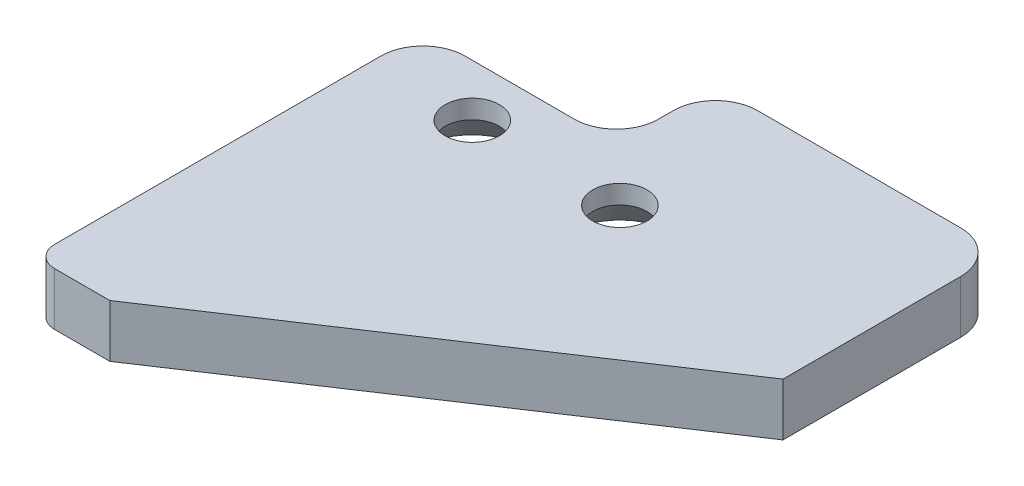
ISO-10303-21;
HEADER;
FILE_DESCRIPTION(('STEP AP214'),'2;1');
FILE_NAME('part.step','',(''),(''),'','','');
FILE_SCHEMA(('AUTOMOTIVE_DESIGN { 1 0 10303 214 1 1 1 1 }'));
ENDSEC;
DATA;
#1=APPLICATION_CONTEXT('core data for automotive mechanical design processes');
#2=APPLICATION_PROTOCOL_DEFINITION('international standard','automotive_design',2000,#1);
#3=PRODUCT_CONTEXT('',#1,'mechanical');
#4=PRODUCT('Part','Part','',(#3));
#5=PRODUCT_RELATED_PRODUCT_CATEGORY('part','',(#4));
#6=PRODUCT_DEFINITION_FORMATION('','',#4);
#7=PRODUCT_DEFINITION_CONTEXT('part definition',#1,'design');
#8=PRODUCT_DEFINITION('design','',#6,#7);
#9=PRODUCT_DEFINITION_SHAPE('','',#8);
#10=(LENGTH_UNIT() NAMED_UNIT(*) SI_UNIT(.MILLI.,.METRE.));
#11=(NAMED_UNIT(*) PLANE_ANGLE_UNIT() SI_UNIT($,.RADIAN.));
#12=(NAMED_UNIT(*) SI_UNIT($,.STERADIAN.) SOLID_ANGLE_UNIT());
#13=UNCERTAINTY_MEASURE_WITH_UNIT(LENGTH_MEASURE(1.E-05),#10,'distance_accuracy_value','');
#14=(GEOMETRIC_REPRESENTATION_CONTEXT(3) GLOBAL_UNCERTAINTY_ASSIGNED_CONTEXT((#13)) GLOBAL_UNIT_ASSIGNED_CONTEXT((#10,
#11,#12)) REPRESENTATION_CONTEXT('',''));
#15=CARTESIAN_POINT('',(0.,0.,0.));
#16=DIRECTION('',(0.,0.,1.));
#17=DIRECTION('',(1.,0.,0.));
#18=AXIS2_PLACEMENT_3D('',#15,#16,#17);
#19=CARTESIAN_POINT('',(-12.144081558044,3.175,15.6036883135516));
#20=DIRECTION('',(0.,1.,0.));
#21=DIRECTION('',(0.,0.,1.));
#22=AXIS2_PLACEMENT_3D('',#19,#20,#21);
#23=CYLINDRICAL_SURFACE('',#22,1.27);
#24=DIRECTION('',(0.,1.,0.));
#25=VECTOR('',#24,1.);
#26=CARTESIAN_POINT('',(-13.414081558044,3.175,15.6036883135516));
#27=LINE('',#26,#25);
#28=CARTESIAN_POINT('',(-13.414081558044,0.,15.6036883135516));
#29=VERTEX_POINT('',#28);
#30=CARTESIAN_POINT('',(-13.414081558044,3.175,15.6036883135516));
#31=VERTEX_POINT('',#30);
#32=EDGE_CURVE('E335',#29,#31,#27,.T.);
#33=ORIENTED_EDGE('',*,*,#32,.F.);
#34=CARTESIAN_POINT('',(-12.144081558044,0.,15.6036883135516));
#35=DIRECTION('',(0.,-1.,0.));
#36=DIRECTION('',(0.,0.,-1.));
#37=AXIS2_PLACEMENT_3D('',#34,#35,#36);
#38=CIRCLE('',#37,1.27);
#39=CARTESIAN_POINT('',(-12.144081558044,0.,16.8736883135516));
#40=VERTEX_POINT('',#39);
#41=EDGE_CURVE('E55',#40,#29,#38,.T.);
#42=ORIENTED_EDGE('',*,*,#41,.F.);
#43=DIRECTION('',(0.,1.,0.));
#44=VECTOR('',#43,1.);
#45=CARTESIAN_POINT('',(-12.144081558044,3.175,16.8736883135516));
#46=LINE('',#45,#44);
#47=CARTESIAN_POINT('',(-12.144081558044,3.175,16.8736883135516));
#48=VERTEX_POINT('',#47);
#49=EDGE_CURVE('E339',#48,#40,#46,.F.);
#50=ORIENTED_EDGE('',*,*,#49,.F.);
#51=CARTESIAN_POINT('',(-12.144081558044,3.175,15.6036883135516));
#52=DIRECTION('',(0.,-1.,0.));
#53=DIRECTION('',(0.,0.,-1.));
#54=AXIS2_PLACEMENT_3D('',#51,#52,#53);
#55=CIRCLE('',#54,1.27);
#56=EDGE_CURVE('E11',#31,#48,#55,.F.);
#57=ORIENTED_EDGE('',*,*,#56,.F.);
#58=EDGE_LOOP('',(#33,#42,#50,#57));
#59=FACE_BOUND('',#58,.T.);
#60=ADVANCED_FACE('F47',(#59),#23,.T.);
#61=CARTESIAN_POINT('',(-10.874081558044,3.175,-4.0364887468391));
#62=DIRECTION('',(0.,1.,0.));
#63=DIRECTION('',(0.,0.,1.));
#64=AXIS2_PLACEMENT_3D('',#61,#62,#63);
#65=CYLINDRICAL_SURFACE('',#64,2.54);
#66=DIRECTION('',(0.,1.,0.));
#67=VECTOR('',#66,1.);
#68=CARTESIAN_POINT('',(-10.874081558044,3.175,-6.5764887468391));
#69=LINE('',#68,#67);
#70=CARTESIAN_POINT('',(-10.874081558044,0.,-6.5764887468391));
#71=VERTEX_POINT('',#70);
#72=CARTESIAN_POINT('',(-10.874081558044,3.175,-6.5764887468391));
#73=VERTEX_POINT('',#72);
#74=EDGE_CURVE('E282',#71,#73,#69,.T.);
#75=ORIENTED_EDGE('',*,*,#74,.F.);
#76=CARTESIAN_POINT('',(-10.874081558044,0.,-4.0364887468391));
#77=DIRECTION('',(0.,-1.,0.));
#78=DIRECTION('',(0.,0.,-1.));
#79=AXIS2_PLACEMENT_3D('',#76,#77,#78);
#80=CIRCLE('',#79,2.54);
#81=CARTESIAN_POINT('',(-13.414081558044,0.,-4.0364887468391));
#82=VERTEX_POINT('',#81);
#83=EDGE_CURVE('E284',#82,#71,#80,.T.);
#84=ORIENTED_EDGE('',*,*,#83,.F.);
#85=DIRECTION('',(0.,1.,0.));
#86=VECTOR('',#85,1.);
#87=CARTESIAN_POINT('',(-13.414081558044,3.175,-4.0364887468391));
#88=LINE('',#87,#86);
#89=CARTESIAN_POINT('',(-13.414081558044,3.175,-4.0364887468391));
#90=VERTEX_POINT('',#89);
#91=EDGE_CURVE('E288',#90,#82,#88,.F.);
#92=ORIENTED_EDGE('',*,*,#91,.F.);
#93=CARTESIAN_POINT('',(-10.874081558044,3.175,-4.0364887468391));
#94=DIRECTION('',(0.,-1.,0.));
#95=DIRECTION('',(0.,0.,-1.));
#96=AXIS2_PLACEMENT_3D('',#93,#94,#95);
#97=CIRCLE('',#96,2.54);
#98=EDGE_CURVE('E286',#73,#90,#97,.F.);
#99=ORIENTED_EDGE('',*,*,#98,.F.);
#100=EDGE_LOOP('',(#75,#84,#92,#99));
#101=FACE_BOUND('',#100,.T.);
#102=ADVANCED_FACE('F272',(#101),#65,.T.);
#103=CARTESIAN_POINT('',(13.0102639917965,3.175,-10.0005375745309));
#104=DIRECTION('',(0.,-1.,0.));
#105=DIRECTION('',(0.,0.,-1.));
#106=AXIS2_PLACEMENT_3D('',#103,#104,#105);
#107=CYLINDRICAL_SURFACE('',#106,2.54);
#108=DIRECTION('',(0.,-1.,0.));
#109=VECTOR('',#108,1.);
#110=CARTESIAN_POINT('',(13.0102639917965,3.175,-12.5405375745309));
#111=LINE('',#110,#109);
#112=CARTESIAN_POINT('',(13.0102639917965,3.175,-12.5405375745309));
#113=VERTEX_POINT('',#112);
#114=CARTESIAN_POINT('',(13.0102639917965,0.,-12.5405375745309));
#115=VERTEX_POINT('',#114);
#116=EDGE_CURVE('E316',#113,#115,#111,.T.);
#117=ORIENTED_EDGE('',*,*,#116,.F.);
#118=CARTESIAN_POINT('',(13.0102639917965,3.175,-10.0005375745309));
#119=DIRECTION('',(0.,-1.,0.));
#120=DIRECTION('',(0.,0.,-1.));
#121=AXIS2_PLACEMENT_3D('',#118,#119,#120);
#122=CIRCLE('',#121,2.54);
#123=CARTESIAN_POINT('',(15.5502639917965,3.175,-10.0005375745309));
#124=VERTEX_POINT('',#123);
#125=EDGE_CURVE('E324',#124,#113,#122,.F.);
#126=ORIENTED_EDGE('',*,*,#125,.F.);
#127=DIRECTION('',(0.,-1.,0.));
#128=VECTOR('',#127,1.);
#129=CARTESIAN_POINT('',(15.5502639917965,3.175,-10.0005375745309));
#130=LINE('',#129,#128);
#131=CARTESIAN_POINT('',(15.5502639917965,0.,-10.0005375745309));
#132=VERTEX_POINT('',#131);
#133=EDGE_CURVE('E320',#132,#124,#130,.F.);
#134=ORIENTED_EDGE('',*,*,#133,.F.);
#135=CARTESIAN_POINT('',(13.0102639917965,0.,-10.0005375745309));
#136=DIRECTION('',(0.,-1.,0.));
#137=DIRECTION('',(0.,0.,-1.));
#138=AXIS2_PLACEMENT_3D('',#135,#136,#137);
#139=CIRCLE('',#138,2.54);
#140=EDGE_CURVE('E289',#115,#132,#139,.T.);
#141=ORIENTED_EDGE('',*,*,#140,.F.);
#142=EDGE_LOOP('',(#117,#126,#134,#141));
#143=FACE_BOUND('',#142,.T.);
#144=ADVANCED_FACE('F269',(#143),#107,.T.);
#145=CARTESIAN_POINT('',(-4.29986492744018,3.175,-9.1164887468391));
#146=DIRECTION('',(0.,-1.,0.));
#147=DIRECTION('',(0.,0.,-1.));
#148=AXIS2_PLACEMENT_3D('',#145,#146,#147);
#149=CYLINDRICAL_SURFACE('',#148,2.54);
#150=DIRECTION('',(0.,1.,0.));
#151=VECTOR('',#150,1.);
#152=CARTESIAN_POINT('',(-1.75986492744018,3.175,-9.1164887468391));
#153=LINE('',#152,#151);
#154=CARTESIAN_POINT('',(-1.75986492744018,0.,-9.1164887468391));
#155=VERTEX_POINT('',#154);
#156=CARTESIAN_POINT('',(-1.75986492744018,3.175,-9.1164887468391));
#157=VERTEX_POINT('',#156);
#158=EDGE_CURVE('E304',#155,#157,#153,.T.);
#159=ORIENTED_EDGE('',*,*,#158,.F.);
#160=CARTESIAN_POINT('',(-4.29986492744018,0.,-9.1164887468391));
#161=DIRECTION('',(0.,-1.,0.));
#162=DIRECTION('',(0.,0.,-1.));
#163=AXIS2_PLACEMENT_3D('',#160,#161,#162);
#164=CIRCLE('',#163,2.54);
#165=CARTESIAN_POINT('',(-4.29986492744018,0.,-6.5764887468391));
#166=VERTEX_POINT('',#165);
#167=EDGE_CURVE('E310',#155,#166,#164,.T.);
#168=ORIENTED_EDGE('',*,*,#167,.T.);
#169=DIRECTION('',(0.,1.,0.));
#170=VECTOR('',#169,1.);
#171=CARTESIAN_POINT('',(-4.29986492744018,3.175,-6.5764887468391));
#172=LINE('',#171,#170);
#173=CARTESIAN_POINT('',(-4.29986492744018,3.175,-6.5764887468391));
#174=VERTEX_POINT('',#173);
#175=EDGE_CURVE('E148',#174,#166,#172,.F.);
#176=ORIENTED_EDGE('',*,*,#175,.F.);
#177=CARTESIAN_POINT('',(-4.29986492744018,3.175,-9.1164887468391));
#178=DIRECTION('',(0.,-1.,0.));
#179=DIRECTION('',(0.,0.,-1.));
#180=AXIS2_PLACEMENT_3D('',#177,#178,#179);
#181=CIRCLE('',#180,2.54);
#182=EDGE_CURVE('E313',#174,#157,#181,.F.);
#183=ORIENTED_EDGE('',*,*,#182,.T.);
#184=EDGE_LOOP('',(#159,#168,#176,#183));
#185=FACE_BOUND('',#184,.T.);
#186=ADVANCED_FACE('F265',(#185),#149,.F.);
#187=CARTESIAN_POINT('',(0.78013507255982,3.175,-10.0005375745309));
#188=DIRECTION('',(0.,-1.,0.));
#189=DIRECTION('',(0.,0.,-1.));
#190=AXIS2_PLACEMENT_3D('',#187,#188,#189);
#191=CYLINDRICAL_SURFACE('',#190,2.54);
#192=DIRECTION('',(0.,-1.,0.));
#193=VECTOR('',#192,1.);
#194=CARTESIAN_POINT('',(-1.75986492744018,3.175,-10.0005375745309));
#195=LINE('',#194,#193);
#196=CARTESIAN_POINT('',(-1.75986492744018,3.175,-10.0005375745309));
#197=VERTEX_POINT('',#196);
#198=CARTESIAN_POINT('',(-1.75986492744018,0.,-10.0005375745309));
#199=VERTEX_POINT('',#198);
#200=EDGE_CURVE('E159',#197,#199,#195,.T.);
#201=ORIENTED_EDGE('',*,*,#200,.F.);
#202=CARTESIAN_POINT('',(0.78013507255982,3.175,-10.0005375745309));
#203=DIRECTION('',(0.,-1.,0.));
#204=DIRECTION('',(0.,0.,-1.));
#205=AXIS2_PLACEMENT_3D('',#202,#203,#204);
#206=CIRCLE('',#205,2.54);
#207=CARTESIAN_POINT('',(0.78013507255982,3.175,-12.5405375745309));
#208=VERTEX_POINT('',#207);
#209=EDGE_CURVE('E298',#208,#197,#206,.F.);
#210=ORIENTED_EDGE('',*,*,#209,.F.);
#211=DIRECTION('',(0.,-1.,0.));
#212=VECTOR('',#211,1.);
#213=CARTESIAN_POINT('',(0.78013507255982,3.175,-12.5405375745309));
#214=LINE('',#213,#212);
#215=CARTESIAN_POINT('',(0.78013507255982,0.,-12.5405375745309));
#216=VERTEX_POINT('',#215);
#217=EDGE_CURVE('E295',#216,#208,#214,.F.);
#218=ORIENTED_EDGE('',*,*,#217,.F.);
#219=CARTESIAN_POINT('',(0.78013507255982,0.,-10.0005375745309));
#220=DIRECTION('',(0.,-1.,0.));
#221=DIRECTION('',(0.,0.,-1.));
#222=AXIS2_PLACEMENT_3D('',#219,#220,#221);
#223=CIRCLE('',#222,2.54);
#224=EDGE_CURVE('E300',#199,#216,#223,.T.);
#225=ORIENTED_EDGE('',*,*,#224,.F.);
#226=EDGE_LOOP('',(#201,#210,#218,#225));
#227=FACE_BOUND('',#226,.T.);
#228=ADVANCED_FACE('F261',(#227),#191,.T.);
#229=CARTESIAN_POINT('',(-1.75986492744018,3.175,-12.5405375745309));
#230=DIRECTION('',(0.,0.,1.));
#231=DIRECTION('',(1.,0.,0.));
#232=AXIS2_PLACEMENT_3D('',#229,#230,#231);
#233=PLANE('',#232);
#234=DIRECTION('',(-1.,0.,0.));
#235=VECTOR('',#234,1.);
#236=CARTESIAN_POINT('',(-1.75986492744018,3.175,-12.5405375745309));
#237=LINE('',#236,#235);
#238=EDGE_CURVE('E189',#113,#208,#237,.T.);
#239=ORIENTED_EDGE('',*,*,#238,.F.);
#240=ORIENTED_EDGE('',*,*,#116,.T.);
#241=DIRECTION('',(-1.,0.,0.));
#242=VECTOR('',#241,1.);
#243=CARTESIAN_POINT('',(-1.75986492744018,0.,-12.5405375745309));
#244=LINE('',#243,#242);
#245=EDGE_CURVE('E188',#115,#216,#244,.T.);
#246=ORIENTED_EDGE('',*,*,#245,.T.);
#247=ORIENTED_EDGE('',*,*,#217,.T.);
#248=EDGE_LOOP('',(#239,#240,#246,#247));
#249=FACE_BOUND('',#248,.T.);
#250=ADVANCED_FACE('F257',(#249),#233,.F.);
#251=CARTESIAN_POINT('',(-1.75986492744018,3.175,-6.5764887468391));
#252=DIRECTION('',(1.,0.,0.));
#253=DIRECTION('',(0.,0.,-1.));
#254=AXIS2_PLACEMENT_3D('',#251,#252,#253);
#255=PLANE('',#254);
#256=DIRECTION('',(0.,0.,1.));
#257=VECTOR('',#256,1.);
#258=CARTESIAN_POINT('',(-1.75986492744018,0.,-6.5764887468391));
#259=LINE('',#258,#257);
#260=EDGE_CURVE('E217',#199,#155,#259,.T.);
#261=ORIENTED_EDGE('',*,*,#260,.T.);
#262=ORIENTED_EDGE('',*,*,#158,.T.);
#263=DIRECTION('',(0.,0.,1.));
#264=VECTOR('',#263,1.);
#265=CARTESIAN_POINT('',(-1.75986492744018,3.175,-6.5764887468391));
#266=LINE('',#265,#264);
#267=EDGE_CURVE('E192',#197,#157,#266,.T.);
#268=ORIENTED_EDGE('',*,*,#267,.F.);
#269=ORIENTED_EDGE('',*,*,#200,.T.);
#270=EDGE_LOOP('',(#261,#262,#268,#269));
#271=FACE_BOUND('',#270,.T.);
#272=ADVANCED_FACE('F253',(#271),#255,.F.);
#273=CARTESIAN_POINT('',(-13.414081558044,3.175,-6.5764887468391));
#274=DIRECTION('',(0.,0.,1.));
#275=DIRECTION('',(1.,0.,0.));
#276=AXIS2_PLACEMENT_3D('',#273,#274,#275);
#277=PLANE('',#276);
#278=DIRECTION('',(-1.,0.,0.));
#279=VECTOR('',#278,1.);
#280=CARTESIAN_POINT('',(-13.414081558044,0.,-6.5764887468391));
#281=LINE('',#280,#279);
#282=CARTESIAN_POINT('',(-8.66129781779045,0.,-6.5764887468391));
#283=VERTEX_POINT('',#282);
#284=EDGE_CURVE('E153',#283,#71,#281,.T.);
#285=ORIENTED_EDGE('',*,*,#284,.T.);
#286=ORIENTED_EDGE('',*,*,#74,.T.);
#287=DIRECTION('',(-1.,0.,0.));
#288=VECTOR('',#287,1.);
#289=CARTESIAN_POINT('',(-13.414081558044,3.175,-6.5764887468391));
#290=LINE('',#289,#288);
#291=EDGE_CURVE('E197',#174,#73,#290,.T.);
#292=ORIENTED_EDGE('',*,*,#291,.F.);
#293=ORIENTED_EDGE('',*,*,#175,.T.);
#294=CARTESIAN_POINT('',(-5.95817419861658,0.,-6.5764887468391));
#295=VERTEX_POINT('',#294);
#296=EDGE_CURVE('E140',#166,#295,#281,.T.);
#297=ORIENTED_EDGE('',*,*,#296,.T.);
#298=CARTESIAN_POINT('',(-17.0291242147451,-7.82422408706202,-6.5764887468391));
#299=CARTESIAN_POINT('',(-16.8010540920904,-7.57451380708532,-6.5764887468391));
#300=CARTESIAN_POINT('',(-16.572593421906,-7.32515837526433,-6.5764887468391));
#301=CARTESIAN_POINT('',(-16.1146453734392,-6.82737069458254,-6.5764887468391));
#302=CARTESIAN_POINT('',(-15.8851579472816,-6.57893848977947,-6.5764887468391));
#303=CARTESIAN_POINT('',(-15.4243137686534,-6.08256819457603,-6.5764887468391));
#304=CARTESIAN_POINT('',(-15.1929536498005,-5.83463322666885,-6.5764887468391));
#305=CARTESIAN_POINT('',(-14.728640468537,-5.34027237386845,-6.5764887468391));
#306=CARTESIAN_POINT('',(-14.4956874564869,-5.09384644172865,-6.5764887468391));
#307=CARTESIAN_POINT('',(-14.0004028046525,-4.57431715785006,-6.5764887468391));
#308=CARTESIAN_POINT('',(-13.737815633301,-4.30145708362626,-6.5764887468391));
#309=CARTESIAN_POINT('',(-13.2090855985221,-3.75913127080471,-6.5764887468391));
#310=CARTESIAN_POINT('',(-12.9429423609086,-3.48966589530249,-6.5764887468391));
#311=CARTESIAN_POINT('',(-12.5401652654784,-3.08948320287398,-6.5764887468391));
#312=CARTESIAN_POINT('',(-12.4054224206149,-2.95686334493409,-6.5764887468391));
#313=CARTESIAN_POINT('',(-12.1344046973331,-2.69320005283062,-6.5764887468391));
#314=CARTESIAN_POINT('',(-11.9981298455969,-2.56215659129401,-6.5764887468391));
#315=CARTESIAN_POINT('',(-11.723727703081,-2.30206983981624,-6.5764887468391));
#316=CARTESIAN_POINT('',(-11.5856007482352,-2.17302619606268,-6.5764887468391));
#317=CARTESIAN_POINT('',(-11.3070244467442,-1.91747562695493,-6.5764887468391));
#318=CARTESIAN_POINT('',(-11.166575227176,-1.79096856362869,-6.5764887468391));
#319=CARTESIAN_POINT('',(-10.9244081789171,-1.57793340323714,-6.5764887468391));
#320=CARTESIAN_POINT('',(-10.8234245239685,-1.49057161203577,-6.5764887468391));
#321=CARTESIAN_POINT('',(-10.6197143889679,-1.31789134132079,-6.5764887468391));
#322=CARTESIAN_POINT('',(-10.5169878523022,-1.23257292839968,-6.5764887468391));
#323=CARTESIAN_POINT('',(-10.3092370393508,-1.06430598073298,-6.5764887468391));
#324=CARTESIAN_POINT('',(-10.2042082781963,-0.981362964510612,-6.5764887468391));
#325=CARTESIAN_POINT('',(-9.99165984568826,-0.818729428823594,-6.5764887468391));
#326=CARTESIAN_POINT('',(-9.88414032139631,-0.739038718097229,-6.5764887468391));
#327=CARTESIAN_POINT('',(-9.66846355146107,-0.585522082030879,-6.5764887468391));
#328=CARTESIAN_POINT('',(-9.56037043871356,-0.511606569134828,-6.5764887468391));
#329=CARTESIAN_POINT('',(-9.34073233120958,-0.368969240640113,-6.5764887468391));
#330=CARTESIAN_POINT('',(-9.22918627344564,-0.300249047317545,-6.5764887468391));
#331=CARTESIAN_POINT('',(-9.00250433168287,-0.169934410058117,-6.5764887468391));
#332=CARTESIAN_POINT('',(-8.88738284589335,-0.108315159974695,-6.5764887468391));
#333=CARTESIAN_POINT('',(-8.65274183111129,0.00579668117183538,-6.5764887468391));
#334=CARTESIAN_POINT('',(-8.53322657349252,0.0582978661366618,-6.5764887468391));
#335=CARTESIAN_POINT('',(-8.3320119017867,0.135141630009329,-6.5764887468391));
#336=CARTESIAN_POINT('',(-8.25162862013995,0.162924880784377,-6.5764887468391));
#337=CARTESIAN_POINT('',(-8.08900554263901,0.212516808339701,-6.5764887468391));
#338=CARTESIAN_POINT('',(-8.00676554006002,0.234324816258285,-6.5764887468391));
#339=CARTESIAN_POINT('',(-7.84108625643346,0.271010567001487,-6.5764887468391));
#340=CARTESIAN_POINT('',(-7.75765321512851,0.285916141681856,-6.5764887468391));
#341=CARTESIAN_POINT('',(-7.58979275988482,0.308218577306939,-6.5764887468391));
#342=CARTESIAN_POINT('',(-7.50536554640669,0.315616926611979,-6.5764887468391));
#343=CARTESIAN_POINT('',(-7.33218731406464,0.322677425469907,-6.5764887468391));
#344=CARTESIAN_POINT('',(-7.24342025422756,0.321958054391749,-6.5764887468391));
#345=CARTESIAN_POINT('',(-7.06638236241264,0.311897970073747,-6.5764887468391));
#346=CARTESIAN_POINT('',(-6.978111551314,0.302556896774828,-6.5764887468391));
#347=CARTESIAN_POINT('',(-6.80247204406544,0.275734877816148,-6.5764887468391));
#348=CARTESIAN_POINT('',(-6.71510836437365,0.258221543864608,-6.5764887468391));
#349=CARTESIAN_POINT('',(-6.54216973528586,0.21592630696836,-6.5764887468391));
#350=CARTESIAN_POINT('',(-6.45659516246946,0.191142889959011,-6.5764887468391));
#351=CARTESIAN_POINT('',(-6.24610168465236,0.121658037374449,-6.5764887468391));
#352=CARTESIAN_POINT('',(-6.12244327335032,0.0731465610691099,-6.5764887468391));
#353=CARTESIAN_POINT('',(-5.87985345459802,-0.0344804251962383,-6.5764887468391));
#354=CARTESIAN_POINT('',(-5.7609253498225,-0.093603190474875,-6.5764887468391));
#355=CARTESIAN_POINT('',(-5.52626772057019,-0.220406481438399,-6.5764887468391));
#356=CARTESIAN_POINT('',(-5.41058062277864,-0.288164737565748,-6.5764887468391));
#357=CARTESIAN_POINT('',(-5.23994823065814,-0.394339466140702,-6.5764887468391));
#358=CARTESIAN_POINT('',(-5.18356266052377,-0.430481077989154,-6.5764887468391));
#359=CARTESIAN_POINT('',(-5.07166823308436,-0.504093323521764,-6.5764887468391));
#360=CARTESIAN_POINT('',(-5.01615933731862,-0.541563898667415,-6.5764887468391));
#361=CARTESIAN_POINT('',(-4.83070523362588,-0.669598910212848,-6.5764887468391));
#362=CARTESIAN_POINT('',(-4.70258831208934,-0.762815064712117,-6.5764887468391));
#363=CARTESIAN_POINT('',(-4.44993358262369,-0.953996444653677,-6.5764887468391));
#364=CARTESIAN_POINT('',(-4.32539674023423,-1.05196293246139,-6.5764887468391));
#365=CARTESIAN_POINT('',(-4.07912728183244,-1.25155564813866,-6.5764887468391));
#366=CARTESIAN_POINT('',(-3.95739712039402,-1.3531848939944,-6.5764887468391));
#367=CARTESIAN_POINT('',(-3.71629425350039,-1.55920933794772,-6.5764887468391));
#368=CARTESIAN_POINT('',(-3.5969217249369,-1.66360474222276,-6.5764887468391));
#369=CARTESIAN_POINT('',(-3.35962925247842,-1.87499531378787,-6.5764887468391));
#370=CARTESIAN_POINT('',(-3.24171724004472,-1.98199936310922,-6.5764887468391));
#371=CARTESIAN_POINT('',(-3.00750594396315,-2.1977604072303,-6.5764887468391));
#372=CARTESIAN_POINT('',(-2.8912067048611,-2.30651745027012,-6.5764887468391));
#373=CARTESIAN_POINT('',(-2.54443531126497,-2.63478706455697,-6.5764887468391));
#374=CARTESIAN_POINT('',(-2.31596330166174,-2.85641186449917,-6.5764887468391));
#375=CARTESIAN_POINT('',(-1.8867964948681,-3.27984622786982,-6.5764887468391));
#376=CARTESIAN_POINT('',(-1.68572019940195,-3.48127159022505,-6.5764887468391));
#377=CARTESIAN_POINT('',(-1.28586184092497,-3.88644257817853,-6.5764887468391));
#378=CARTESIAN_POINT('',(-1.08708011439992,-4.09018853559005,-6.5764887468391));
#379=CARTESIAN_POINT('',(-0.692996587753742,-4.49767947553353,-6.5764887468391));
#380=CARTESIAN_POINT('',(-0.497679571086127,-4.70140977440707,-6.5764887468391));
#381=CARTESIAN_POINT('',(-0.108506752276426,-5.11018610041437,-6.5764887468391));
#382=CARTESIAN_POINT('',(0.0853493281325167,-5.31523186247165,-6.5764887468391));
#383=CARTESIAN_POINT('',(0.278666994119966,-5.5207795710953,-6.5764887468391));
#384=B_SPLINE_CURVE_WITH_KNOTS('',3,(#298,#299,#300,#301,#302,#303,#304,#305,#306,#307,#308,
#309,#310,#311,#312,#313,#314,#315,#316,#317,#318,#319,#320,#321,#322,#323,#324,#325,#326,#327,
#328,#329,#330,#331,#332,#333,#334,#335,#336,#337,#338,#339,#340,#341,#342,#343,#344,#345,#346,
#347,#348,#349,#350,#351,#352,#353,#354,#355,#356,#357,#358,#359,#360,#361,#362,#363,#364,#365,
#366,#367,#368,#369,#370,#371,#372,#373,#374,#375,#376,#377,#378,#379,#380,#381,#382,#383),
.UNSPECIFIED.,.F.,.F.,(4,2,2,2,2,2,2,2,2,2,2,2,2,2,2,2,2,2,2,2,2,2,2,2,2,2,2,2,2,2,2,2,2,2,2,2,
2,2,2,2,2,2,4),(0.,1.01456600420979,2.02917981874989,3.04652053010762,4.06382922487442,
5.19987383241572,6.33603893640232,6.90320910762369,7.47036941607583,8.03742820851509,
8.60445607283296,9.00501943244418,9.40559582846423,9.80703769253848,10.208455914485,
10.6011887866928,10.9940437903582,11.3854819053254,11.7765490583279,12.0315052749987,
12.2864900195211,12.540437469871,12.7943345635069,13.0602122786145,13.3261010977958,
13.5930527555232,13.8600600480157,14.2578574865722,14.6559279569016,15.0578749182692,
15.2587836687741,15.4596835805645,15.9348334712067,16.4101103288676,16.88578817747,
17.3615015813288,17.8391593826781,18.3168303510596,19.271662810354,20.1254787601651,
20.9794183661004,21.8261065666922,22.672629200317),.UNSPECIFIED.);
#385=EDGE_CURVE('E144',#295,#283,#384,.F.);
#386=ORIENTED_EDGE('',*,*,#385,.T.);
#387=EDGE_LOOP('',(#285,#286,#292,#293,#297,#386));
#388=FACE_BOUND('',#387,.T.);
#389=ADVANCED_FACE('F143',(#388),#277,.F.);
#390=CARTESIAN_POINT('',(-13.414081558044,3.175,16.8736883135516));
#391=DIRECTION('',(1.,0.,0.));
#392=DIRECTION('',(0.,0.,-1.));
#393=AXIS2_PLACEMENT_3D('',#390,#391,#392);
#394=PLANE('',#393);
#395=DIRECTION('',(0.,0.,1.));
#396=VECTOR('',#395,1.);
#397=CARTESIAN_POINT('',(-13.414081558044,0.,16.8736883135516));
#398=LINE('',#397,#396);
#399=EDGE_CURVE('E152',#82,#29,#398,.T.);
#400=ORIENTED_EDGE('',*,*,#399,.T.);
#401=ORIENTED_EDGE('',*,*,#32,.T.);
#402=DIRECTION('',(0.,0.,1.));
#403=VECTOR('',#402,1.);
#404=CARTESIAN_POINT('',(-13.414081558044,3.175,16.8736883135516));
#405=LINE('',#404,#403);
#406=EDGE_CURVE('E201',#90,#31,#405,.T.);
#407=ORIENTED_EDGE('',*,*,#406,.F.);
#408=ORIENTED_EDGE('',*,*,#91,.T.);
#409=EDGE_LOOP('',(#400,#401,#407,#408));
#410=FACE_BOUND('',#409,.T.);
#411=ADVANCED_FACE('F252',(#410),#394,.F.);
#412=CARTESIAN_POINT('',(-8.82375940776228,3.175,16.8736883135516));
#413=DIRECTION('',(0.,0.,-1.));
#414=DIRECTION('',(-1.,0.,0.));
#415=AXIS2_PLACEMENT_3D('',#412,#413,#414);
#416=PLANE('',#415);
#417=DIRECTION('',(1.,0.,0.));
#418=VECTOR('',#417,1.);
#419=CARTESIAN_POINT('',(-8.82375940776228,3.175,16.8736883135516));
#420=LINE('',#419,#418);
#421=CARTESIAN_POINT('',(-8.82375940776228,3.175,16.8736883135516));
#422=VERTEX_POINT('',#421);
#423=EDGE_CURVE('E204',#48,#422,#420,.T.);
#424=ORIENTED_EDGE('',*,*,#423,.F.);
#425=ORIENTED_EDGE('',*,*,#49,.T.);
#426=DIRECTION('',(1.,0.,0.));
#427=VECTOR('',#426,1.);
#428=CARTESIAN_POINT('',(-8.82375940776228,0.,16.8736883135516));
#429=LINE('',#428,#427);
#430=CARTESIAN_POINT('',(-8.82375940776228,0.,16.8736883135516));
#431=VERTEX_POINT('',#430);
#432=EDGE_CURVE('E224',#40,#431,#429,.T.);
#433=ORIENTED_EDGE('',*,*,#432,.T.);
#434=DIRECTION('',(0.,-1.,0.));
#435=VECTOR('',#434,1.);
#436=CARTESIAN_POINT('',(-8.82375940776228,3.175,16.8736883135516));
#437=LINE('',#436,#435);
#438=EDGE_CURVE('E160',#422,#431,#437,.T.);
#439=ORIENTED_EDGE('',*,*,#438,.F.);
#440=EDGE_LOOP('',(#424,#425,#433,#439));
#441=FACE_BOUND('',#440,.T.);
#442=ADVANCED_FACE('F370',(#441),#416,.F.);
#443=CARTESIAN_POINT('',(-8.82375940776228,3.175,16.8736883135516));
#444=DIRECTION('',(-0.552919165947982,0.,-0.833234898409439));
#445=DIRECTION('',(-0.833234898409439,0.,0.552919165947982));
#446=AXIS2_PLACEMENT_3D('',#443,#444,#445);
#447=PLANE('',#446);
#448=DIRECTION('',(0.833234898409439,0.,-0.552919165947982));
#449=VECTOR('',#448,1.);
#450=CARTESIAN_POINT('',(-8.82375940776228,0.,16.8736883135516));
#451=LINE('',#450,#449);
#452=CARTESIAN_POINT('',(15.5502639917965,0.,0.699540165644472));
#453=VERTEX_POINT('',#452);
#454=EDGE_CURVE('E227',#431,#453,#451,.T.);
#455=ORIENTED_EDGE('',*,*,#454,.T.);
#456=DIRECTION('',(0.,-1.,0.));
#457=VECTOR('',#456,1.);
#458=CARTESIAN_POINT('',(15.5502639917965,3.175,0.699540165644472));
#459=LINE('',#458,#457);
#460=CARTESIAN_POINT('',(15.5502639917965,3.175,0.699540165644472));
#461=VERTEX_POINT('',#460);
#462=EDGE_CURVE('E214',#461,#453,#459,.T.);
#463=ORIENTED_EDGE('',*,*,#462,.F.);
#464=DIRECTION('',(0.833234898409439,0.,-0.552919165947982));
#465=VECTOR('',#464,1.);
#466=CARTESIAN_POINT('',(-8.82375940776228,3.175,16.8736883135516));
#467=LINE('',#466,#465);
#468=EDGE_CURVE('E207',#422,#461,#467,.T.);
#469=ORIENTED_EDGE('',*,*,#468,.F.);
#470=ORIENTED_EDGE('',*,*,#438,.T.);
#471=EDGE_LOOP('',(#455,#463,#469,#470));
#472=FACE_BOUND('',#471,.T.);
#473=ADVANCED_FACE('F366',(#472),#447,.F.);
#474=CARTESIAN_POINT('',(15.5502639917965,3.175,-12.5405375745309));
#475=DIRECTION('',(-1.,0.,0.));
#476=DIRECTION('',(0.,0.,1.));
#477=AXIS2_PLACEMENT_3D('',#474,#475,#476);
#478=PLANE('',#477);
#479=DIRECTION('',(0.,0.,-1.));
#480=VECTOR('',#479,1.);
#481=CARTESIAN_POINT('',(15.5502639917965,0.,-12.5405375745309));
#482=LINE('',#481,#480);
#483=EDGE_CURVE('E193',#453,#132,#482,.T.);
#484=ORIENTED_EDGE('',*,*,#483,.T.);
#485=ORIENTED_EDGE('',*,*,#133,.T.);
#486=DIRECTION('',(0.,0.,-1.));
#487=VECTOR('',#486,1.);
#488=CARTESIAN_POINT('',(15.5502639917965,3.175,-12.5405375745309));
#489=LINE('',#488,#487);
#490=EDGE_CURVE('E210',#461,#124,#489,.T.);
#491=ORIENTED_EDGE('',*,*,#490,.F.);
#492=ORIENTED_EDGE('',*,*,#462,.T.);
#493=EDGE_LOOP('',(#484,#485,#491,#492));
#494=FACE_BOUND('',#493,.T.);
#495=ADVANCED_FACE('F362',(#494),#478,.F.);
#496=CARTESIAN_POINT('',(0.,3.175,0.));
#497=DIRECTION('',(0.,-1.,0.));
#498=DIRECTION('',(0.,0.,-1.));
#499=AXIS2_PLACEMENT_3D('',#496,#497,#498);
#500=PLANE('',#499);
#501=ORIENTED_EDGE('',*,*,#406,.T.);
#502=ORIENTED_EDGE('',*,*,#56,.T.);
#503=ORIENTED_EDGE('',*,*,#423,.T.);
#504=ORIENTED_EDGE('',*,*,#468,.T.);
#505=ORIENTED_EDGE('',*,*,#490,.T.);
#506=ORIENTED_EDGE('',*,*,#125,.T.);
#507=ORIENTED_EDGE('',*,*,#238,.T.);
#508=ORIENTED_EDGE('',*,*,#209,.T.);
#509=ORIENTED_EDGE('',*,*,#267,.T.);
#510=ORIENTED_EDGE('',*,*,#182,.F.);
#511=ORIENTED_EDGE('',*,*,#291,.T.);
#512=ORIENTED_EDGE('',*,*,#98,.T.);
#513=EDGE_LOOP('',(#501,#502,#503,#504,#505,#506,#507,#508,#509,#510,#511,#512));
#514=FACE_BOUND('',#513,.T.);
#515=CARTESIAN_POINT('',(-7.30973600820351,3.175,-3.44631168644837));
#516=DIRECTION('',(0.,-1.,0.));
#517=DIRECTION('',(0.,0.,-1.));
#518=AXIS2_PLACEMENT_3D('',#515,#516,#517);
#519=CIRCLE('',#518,1.63195);
#520=CARTESIAN_POINT('',(-7.30973600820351,3.175,-5.07826168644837));
#521=VERTEX_POINT('',#520);
#522=EDGE_CURVE('E170',#521,#521,#519,.T.);
#523=ORIENTED_EDGE('',*,*,#522,.T.);
#524=EDGE_LOOP('',(#523));
#525=FACE_BOUND('',#524,.T.);
#526=CARTESIAN_POINT('',(1.58026399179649,3.175,-3.44631168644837));
#527=DIRECTION('',(0.,-1.,0.));
#528=DIRECTION('',(0.,0.,-1.));
#529=AXIS2_PLACEMENT_3D('',#526,#527,#528);
#530=CIRCLE('',#529,1.63195);
#531=CARTESIAN_POINT('',(1.58026399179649,3.175,-5.07826168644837));
#532=VERTEX_POINT('',#531);
#533=EDGE_CURVE('E184',#532,#532,#530,.T.);
#534=ORIENTED_EDGE('',*,*,#533,.T.);
#535=EDGE_LOOP('',(#534));
#536=FACE_BOUND('',#535,.T.);
#537=ADVANCED_FACE('F347',(#514,#525,#536),#500,.F.);
#538=CARTESIAN_POINT('',(0.,0.,0.));
#539=DIRECTION('',(0.,-1.,0.));
#540=DIRECTION('',(0.,0.,-1.));
#541=AXIS2_PLACEMENT_3D('',#538,#539,#540);
#542=PLANE('',#541);
#543=ORIENTED_EDGE('',*,*,#432,.F.);
#544=ORIENTED_EDGE('',*,*,#41,.T.);
#545=ORIENTED_EDGE('',*,*,#399,.F.);
#546=ORIENTED_EDGE('',*,*,#83,.T.);
#547=ORIENTED_EDGE('',*,*,#284,.F.);
#548=CARTESIAN_POINT('',(-7.30973600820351,0.,-3.44631168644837));
#549=DIRECTION('',(0.,-1.,0.));
#550=DIRECTION('',(0.,0.,-1.));
#551=AXIS2_PLACEMENT_3D('',#548,#549,#550);
#552=CIRCLE('',#551,3.4095055);
#553=EDGE_CURVE('E157',#295,#283,#552,.T.);
#554=ORIENTED_EDGE('',*,*,#553,.F.);
#555=ORIENTED_EDGE('',*,*,#296,.F.);
#556=ORIENTED_EDGE('',*,*,#167,.F.);
#557=ORIENTED_EDGE('',*,*,#260,.F.);
#558=ORIENTED_EDGE('',*,*,#224,.T.);
#559=ORIENTED_EDGE('',*,*,#245,.F.);
#560=ORIENTED_EDGE('',*,*,#140,.T.);
#561=ORIENTED_EDGE('',*,*,#483,.F.);
#562=ORIENTED_EDGE('',*,*,#454,.F.);
#563=EDGE_LOOP('',(#543,#544,#545,#546,#547,#554,#555,#556,#557,#558,#559,#560,#561,#562));
#564=FACE_BOUND('',#563,.T.);
#565=CARTESIAN_POINT('',(1.58026399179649,0.,-3.44631168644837));
#566=DIRECTION('',(0.,-1.,0.));
#567=DIRECTION('',(0.,0.,-1.));
#568=AXIS2_PLACEMENT_3D('',#565,#566,#567);
#569=CIRCLE('',#568,3.4095055);
#570=CARTESIAN_POINT('',(1.58026399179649,0.,-6.85581718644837));
#571=VERTEX_POINT('',#570);
#572=EDGE_CURVE('E176',#571,#571,#569,.T.);
#573=ORIENTED_EDGE('',*,*,#572,.F.);
#574=EDGE_LOOP('',(#573));
#575=FACE_BOUND('',#574,.T.);
#576=ADVANCED_FACE('F163',(#564,#575),#542,.T.);
#577=CARTESIAN_POINT('',(1.58026399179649,0.,-3.44631168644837));
#578=DIRECTION('',(0.,-1.,0.));
#579=DIRECTION('',(0.,0.,-1.));
#580=AXIS2_PLACEMENT_3D('',#577,#578,#579);
#581=CYLINDRICAL_SURFACE('',#580,1.63195);
#582=ORIENTED_EDGE('',*,*,#533,.F.);
#583=EDGE_LOOP('',(#582));
#584=FACE_BOUND('',#583,.T.);
#585=CARTESIAN_POINT('',(1.58026399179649,2.04484368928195,-3.44631168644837));
#586=DIRECTION('',(0.,-1.,0.));
#587=DIRECTION('',(0.,0.,-1.));
#588=AXIS2_PLACEMENT_3D('',#585,#586,#587);
#589=CIRCLE('',#588,1.63195);
#590=CARTESIAN_POINT('',(1.58026399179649,2.04484368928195,-5.07826168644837));
#591=VERTEX_POINT('',#590);
#592=EDGE_CURVE('E180',#591,#591,#589,.T.);
#593=ORIENTED_EDGE('',*,*,#592,.T.);
#594=EDGE_LOOP('',(#593));
#595=FACE_BOUND('',#594,.T.);
#596=ADVANCED_FACE('F382',(#584,#595),#581,.F.);
#597=CARTESIAN_POINT('',(1.58026399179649,0.,-3.44631168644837));
#598=DIRECTION('',(0.,-1.,0.));
#599=DIRECTION('',(0.,0.,-1.));
#600=AXIS2_PLACEMENT_3D('',#597,#598,#599);
#601=CONICAL_SURFACE('',#600,3.4095055,0.715584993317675);
#602=ORIENTED_EDGE('',*,*,#592,.F.);
#603=EDGE_LOOP('',(#602));
#604=FACE_BOUND('',#603,.T.);
#605=ORIENTED_EDGE('',*,*,#572,.T.);
#606=EDGE_LOOP('',(#605));
#607=FACE_BOUND('',#606,.T.);
#608=ADVANCED_FACE('F386',(#604,#607),#601,.F.);
#609=CARTESIAN_POINT('',(-7.30973600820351,0.,-3.44631168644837));
#610=DIRECTION('',(0.,-1.,0.));
#611=DIRECTION('',(0.,0.,-1.));
#612=AXIS2_PLACEMENT_3D('',#609,#610,#611);
#613=CONICAL_SURFACE('',#612,3.4095055,0.715584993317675);
#614=CARTESIAN_POINT('',(-7.30973600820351,2.04484368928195,-3.44631168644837));
#615=DIRECTION('',(0.,-1.,0.));
#616=DIRECTION('',(0.,0.,-1.));
#617=AXIS2_PLACEMENT_3D('',#614,#615,#616);
#618=CIRCLE('',#617,1.63195);
#619=CARTESIAN_POINT('',(-7.30973600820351,2.04484368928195,-5.07826168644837));
#620=VERTEX_POINT('',#619);
#621=EDGE_CURVE('E166',#620,#620,#618,.T.);
#622=ORIENTED_EDGE('',*,*,#621,.F.);
#623=EDGE_LOOP('',(#622));
#624=FACE_BOUND('',#623,.T.);
#625=ORIENTED_EDGE('',*,*,#553,.T.);
#626=ORIENTED_EDGE('',*,*,#385,.F.);
#627=EDGE_LOOP('',(#625,#626));
#628=FACE_BOUND('',#627,.T.);
#629=ADVANCED_FACE('F156',(#624,#628),#613,.F.);
#630=CARTESIAN_POINT('',(-7.30973600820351,0.,-3.44631168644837));
#631=DIRECTION('',(0.,-1.,0.));
#632=DIRECTION('',(0.,0.,-1.));
#633=AXIS2_PLACEMENT_3D('',#630,#631,#632);
#634=CYLINDRICAL_SURFACE('',#633,1.63195);
#635=ORIENTED_EDGE('',*,*,#522,.F.);
#636=EDGE_LOOP('',(#635));
#637=FACE_BOUND('',#636,.T.);
#638=ORIENTED_EDGE('',*,*,#621,.T.);
#639=EDGE_LOOP('',(#638));
#640=FACE_BOUND('',#639,.T.);
#641=ADVANCED_FACE('F390',(#637,#640),#634,.F.);
#642=CLOSED_SHELL('',(#60,#102,#144,#186,#228,#250,#272,#389,#411,#442,#473,#495,#537,#576,#596,
#608,#629,#641));
#643=MANIFOLD_SOLID_BREP('B2',#642);
#644=ADVANCED_BREP_SHAPE_REPRESENTATION('',(#18,#643),#14);
#645=SHAPE_DEFINITION_REPRESENTATION(#9,#644);
ENDSEC;
END-ISO-10303-21;
